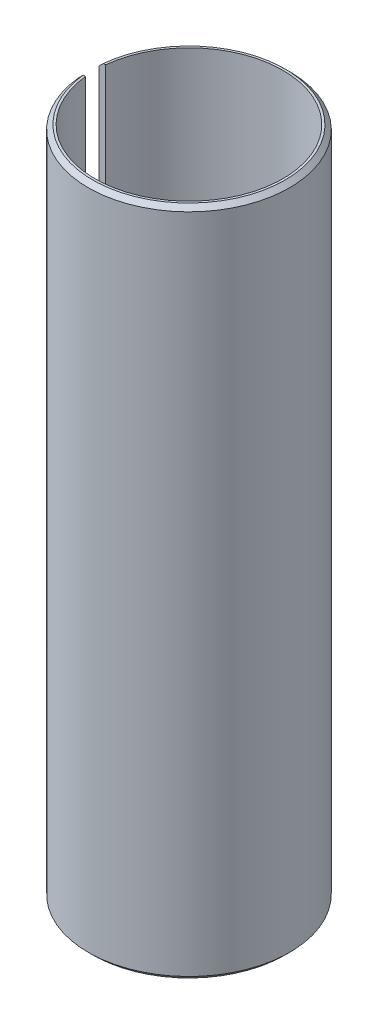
from build123d import *

# Parameters (mm, degrees)
ESQUISSE1_W                  = 0.2
ESQUISSE1_H                  = 20
CHANFREIN1_SIZE              = 0.133333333
ENL_V_MAT_EXTRU_1_DEPTH      = 11.862780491
ENL_V_MAT_EXTRU_1_DEPTH_BACK = 11.862780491
ESQUISSE2_W                  = 3
ESQUISSE2_H                  = 0.6


with BuildPart() as part:
    # Esquisse1 → Base-R_volution (revolve)
    with BuildSketch(Plane.XY, mode=Mode.PRIVATE) as base_r_volution_sk:
        with Locations((2.9, 0)):
            Rectangle(ESQUISSE1_W, ESQUISSE1_H)
    revolve(base_r_volution_sk.sketch.rotate(Axis((0, 10, 0), (0, -1, 0)), 90), axis=Axis((0, 10, 0), (0, -1, 0)))

    # Chanfrein1
    chanfrein1_edges = [part.edges().sort_by_distance(p)[0] for p in [
        (0, -10, -3),
        (0, 10, -3),
    ]]
    chamfer(chanfrein1_edges, length=CHANFREIN1_SIZE)

    # Esquisse2 → Enl_v. mat.-Extru.1 (cut, two sides: drawn at the far end of the back side and taken through both)
    with BuildSketch(Plane(origin=(0, 0, 0), x_dir=(-1, 0, 0), z_dir=(0, 1, 0)).offset(-ENL_V_MAT_EXTRU_1_DEPTH_BACK)):
        with Locations((1.5, 0)):
            Rectangle(ESQUISSE2_W, ESQUISSE2_H)
    extrude(amount=ENL_V_MAT_EXTRU_1_DEPTH + ENL_V_MAT_EXTRU_1_DEPTH_BACK, mode=Mode.SUBTRACT)


solid = part.part
